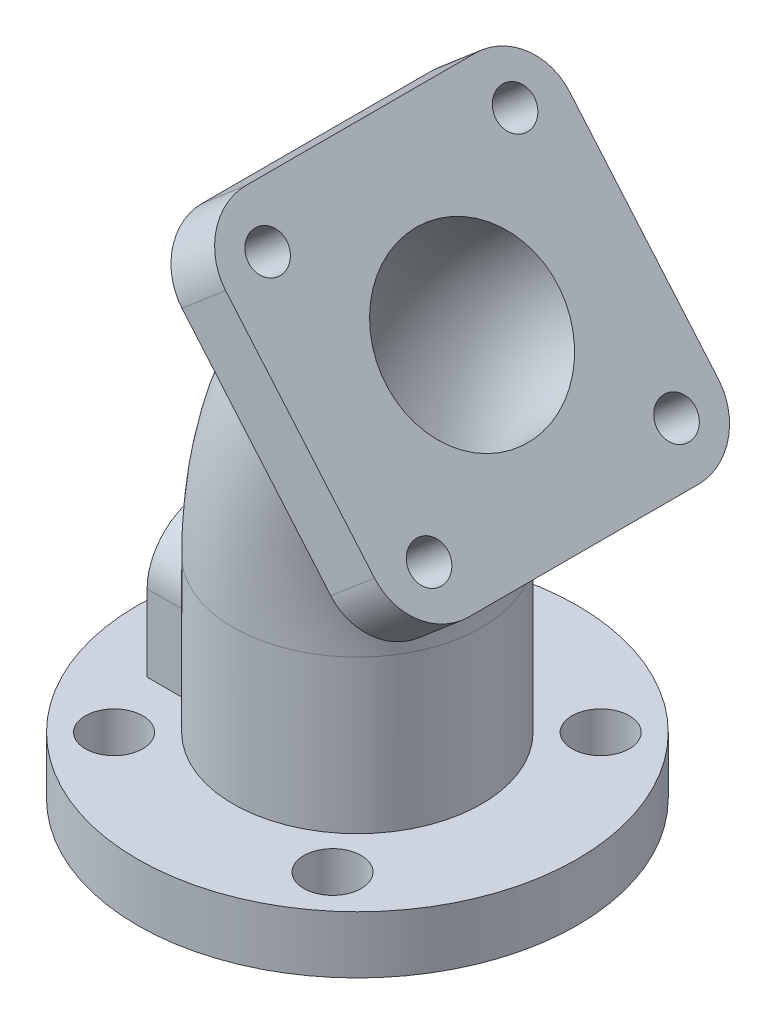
ISO-10303-21;
HEADER;
FILE_DESCRIPTION(('STEP AP214'),'2;1');
FILE_NAME('part.step','',(''),(''),'','','');
FILE_SCHEMA(('AUTOMOTIVE_DESIGN { 1 0 10303 214 1 1 1 1 }'));
ENDSEC;
DATA;
#1=APPLICATION_CONTEXT('core data for automotive mechanical design processes');
#2=APPLICATION_PROTOCOL_DEFINITION('international standard','automotive_design',2000,#1);
#3=PRODUCT_CONTEXT('',#1,'mechanical');
#4=PRODUCT('Part','Part','',(#3));
#5=PRODUCT_RELATED_PRODUCT_CATEGORY('part','',(#4));
#6=PRODUCT_DEFINITION_FORMATION('','',#4);
#7=PRODUCT_DEFINITION_CONTEXT('part definition',#1,'design');
#8=PRODUCT_DEFINITION('design','',#6,#7);
#9=PRODUCT_DEFINITION_SHAPE('','',#8);
#10=(LENGTH_UNIT() NAMED_UNIT(*) SI_UNIT(.MILLI.,.METRE.));
#11=(NAMED_UNIT(*) PLANE_ANGLE_UNIT() SI_UNIT($,.RADIAN.));
#12=(NAMED_UNIT(*) SI_UNIT($,.STERADIAN.) SOLID_ANGLE_UNIT());
#13=UNCERTAINTY_MEASURE_WITH_UNIT(LENGTH_MEASURE(1.E-05),#10,'distance_accuracy_value','');
#14=(GEOMETRIC_REPRESENTATION_CONTEXT(3) GLOBAL_UNCERTAINTY_ASSIGNED_CONTEXT((#13)) GLOBAL_UNIT_ASSIGNED_CONTEXT((#10,
#11,#12)) REPRESENTATION_CONTEXT('',''));
#15=CARTESIAN_POINT('',(0.,0.,0.));
#16=DIRECTION('',(0.,0.,1.));
#17=DIRECTION('',(1.,0.,0.));
#18=AXIS2_PLACEMENT_3D('',#15,#16,#17);
#19=CARTESIAN_POINT('',(0.,22.,0.));
#20=DIRECTION('',(0.,-1.,0.));
#21=DIRECTION('',(0.,0.,-1.));
#22=AXIS2_PLACEMENT_3D('',#19,#20,#21);
#23=CYLINDRICAL_SURFACE('',#22,13.);
#24=CARTESIAN_POINT('',(0.,22.,0.));
#25=DIRECTION('',(0.,1.,0.));
#26=DIRECTION('',(0.,0.,1.));
#27=AXIS2_PLACEMENT_3D('',#24,#25,#26);
#28=CIRCLE('',#27,13.);
#29=CARTESIAN_POINT('',(0.,22.,13.));
#30=VERTEX_POINT('',#29);
#31=EDGE_CURVE('E44',#30,#30,#28,.T.);
#32=ORIENTED_EDGE('',*,*,#31,.F.);
#33=EDGE_LOOP('',(#32));
#34=FACE_BOUND('',#33,.T.);
#35=DIRECTION('',(0.,-1.,0.));
#36=VECTOR('',#35,1.);
#37=CARTESIAN_POINT('',(-11.5325625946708,22.,-6.));
#38=LINE('',#37,#36);
#39=CARTESIAN_POINT('',(-11.5325625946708,6.,-6.));
#40=VERTEX_POINT('',#39);
#41=CARTESIAN_POINT('',(-11.5325625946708,14.,-6.));
#42=VERTEX_POINT('',#41);
#43=EDGE_CURVE('E51',#40,#42,#38,.F.);
#44=ORIENTED_EDGE('',*,*,#43,.T.);
#45=CARTESIAN_POINT('',(-11.5325625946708,14.,-6.));
#46=CARTESIAN_POINT('',(-11.5325209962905,14.1589053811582,-6.00002784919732));
#47=CARTESIAN_POINT('',(-11.5358455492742,14.3177921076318,-5.99368858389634));
#48=CARTESIAN_POINT('',(-11.548918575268,14.6342241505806,-5.96848785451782));
#49=CARTESIAN_POINT('',(-11.5586637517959,14.7917701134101,-5.94963281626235));
#50=CARTESIAN_POINT('',(-11.5842063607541,15.1036023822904,-5.8997369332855));
#51=CARTESIAN_POINT('',(-11.5999733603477,15.2579010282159,-5.86875734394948));
#52=CARTESIAN_POINT('',(-11.6370087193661,15.5629740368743,-5.79497550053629));
#53=CARTESIAN_POINT('',(-11.65827758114,15.7137480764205,-5.75217216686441));
#54=CARTESIAN_POINT('',(-11.7055871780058,16.0105205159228,-5.65527380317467));
#55=CARTESIAN_POINT('',(-11.7316185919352,16.1565275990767,-5.60120080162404));
#56=CARTESIAN_POINT('',(-11.7876960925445,16.4432727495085,-5.4822028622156));
#57=CARTESIAN_POINT('',(-11.8177436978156,16.5840087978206,-5.41727381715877));
#58=CARTESIAN_POINT('',(-11.9127142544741,16.9974364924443,-5.20681638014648));
#59=CARTESIAN_POINT('',(-11.9824494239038,17.2612556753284,-5.04564800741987));
#60=CARTESIAN_POINT('',(-12.1326813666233,17.7771982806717,-4.67343852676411));
#61=CARTESIAN_POINT('',(-12.2135887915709,18.0272539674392,-4.45972083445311));
#62=CARTESIAN_POINT('',(-12.3737525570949,18.4896324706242,-3.99383731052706));
#63=CARTESIAN_POINT('',(-12.4530084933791,18.7019461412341,-3.74166218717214));
#64=CARTESIAN_POINT('',(-12.5668091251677,18.9933205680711,-3.33123038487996));
#65=CARTESIAN_POINT('',(-12.604811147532,19.0880002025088,-3.18477413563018));
#66=CARTESIAN_POINT('',(-12.6771189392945,19.2645834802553,-2.8835049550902));
#67=CARTESIAN_POINT('',(-12.7114261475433,19.3464921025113,-2.72869531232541));
#68=CARTESIAN_POINT('',(-12.7753528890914,19.4967502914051,-2.41174186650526));
#69=CARTESIAN_POINT('',(-12.8049733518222,19.5651025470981,-2.24959952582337));
#70=CARTESIAN_POINT('',(-12.8586543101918,19.6875320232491,-1.91911912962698));
#71=CARTESIAN_POINT('',(-12.8827152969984,19.7416105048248,-1.75078162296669));
#72=CARTESIAN_POINT('',(-12.9232348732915,19.8319399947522,-1.4198727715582));
#73=CARTESIAN_POINT('',(-12.9400729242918,19.8690898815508,-1.2575929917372));
#74=CARTESIAN_POINT('',(-12.967732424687,19.9298243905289,-0.930013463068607));
#75=CARTESIAN_POINT('',(-12.9785543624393,19.9534101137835,-0.764713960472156));
#76=CARTESIAN_POINT('',(-12.99386730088,19.9867191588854,-0.43249652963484));
#77=CARTESIAN_POINT('',(-12.9983607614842,19.9964478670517,-0.26557925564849));
#78=CARTESIAN_POINT('',(-13.0008925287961,20.0019341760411,0.0685301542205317));
#79=CARTESIAN_POINT('',(-12.9989311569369,19.997692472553,0.235722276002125));
#80=CARTESIAN_POINT('',(-12.9889988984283,19.9761335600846,0.556517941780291));
#81=CARTESIAN_POINT('',(-12.9814875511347,19.9598160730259,0.710204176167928));
#82=CARTESIAN_POINT('',(-12.9611744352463,19.9154401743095,1.01556784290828));
#83=CARTESIAN_POINT('',(-12.9483709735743,19.8873780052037,1.16724461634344));
#84=CARTESIAN_POINT('',(-12.9177914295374,19.8198145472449,1.46745509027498));
#85=CARTESIAN_POINT('',(-12.9000170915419,19.7803172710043,1.61598987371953));
#86=CARTESIAN_POINT('',(-12.8599100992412,19.6902471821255,1.9090847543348));
#87=CARTESIAN_POINT('',(-12.8375757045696,19.6396701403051,2.0536433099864));
#88=CARTESIAN_POINT('',(-12.78850865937,19.5270751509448,2.33996618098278));
#89=CARTESIAN_POINT('',(-12.7617165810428,19.4649010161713,2.48165893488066));
#90=CARTESIAN_POINT('',(-12.7045872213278,19.3301269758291,2.75927329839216));
#91=CARTESIAN_POINT('',(-12.6742486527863,19.2575232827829,2.89519278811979));
#92=CARTESIAN_POINT('',(-12.578911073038,19.0248474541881,3.29320920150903));
#93=CARTESIAN_POINT('',(-12.5095598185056,18.8498431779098,3.54573414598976));
#94=CARTESIAN_POINT('',(-12.3592444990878,18.4484176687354,4.03997789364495));
#95=CARTESIAN_POINT('',(-12.2777942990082,18.2189234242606,4.2790340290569));
#96=CARTESIAN_POINT('',(-12.1163930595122,17.723140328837,4.71672181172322));
#97=CARTESIAN_POINT('',(-12.0364430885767,17.4568263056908,4.91532557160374));
#98=CARTESIAN_POINT('',(-11.9224378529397,17.0273525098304,5.18319876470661));
#99=CARTESIAN_POINT('',(-11.884627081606,16.8753103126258,5.26908064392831));
#100=CARTESIAN_POINT('',(-11.8130826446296,16.5635725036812,5.42758022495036));
#101=CARTESIAN_POINT('',(-11.7793471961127,16.4038802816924,5.50020373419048));
#102=CARTESIAN_POINT('',(-11.7172085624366,16.078098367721,5.63136702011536));
#103=CARTESIAN_POINT('',(-11.6887972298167,15.912018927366,5.68992835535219));
#104=CARTESIAN_POINT('',(-11.6383567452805,15.5745427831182,5.79240100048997));
#105=CARTESIAN_POINT('',(-11.6163247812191,15.4031484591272,5.83631876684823));
#106=CARTESIAN_POINT('',(-11.5766050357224,15.0284625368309,5.91476890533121));
#107=CARTESIAN_POINT('',(-11.5601823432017,14.8244671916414,5.94666297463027));
#108=CARTESIAN_POINT('',(-11.5436628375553,14.516449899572,5.97862623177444));
#109=CARTESIAN_POINT('',(-11.539508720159,14.4133965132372,5.98663436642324));
#110=CARTESIAN_POINT('',(-11.5339559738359,14.20690421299,5.99732270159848));
#111=CARTESIAN_POINT('',(-11.5325583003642,14.1034651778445,6.00000105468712));
#112=CARTESIAN_POINT('',(-11.5325625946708,14.,6.));
#113=B_SPLINE_CURVE_WITH_KNOTS('',3,(#45,#46,#47,#48,#49,#50,#51,#52,#53,#54,#55,#56,#57,#58,
#59,#60,#61,#62,#63,#64,#65,#66,#67,#68,#69,#70,#71,#72,#73,#74,#75,#76,#77,#78,#79,#80,#81,#82,
#83,#84,#85,#86,#87,#88,#89,#90,#91,#92,#93,#94,#95,#96,#97,#98,#99,#100,#101,#102,#103,#104,
#105,#106,#107,#108,#109,#110,#111,#112),.UNSPECIFIED.,.F.,.F.,(4,2,2,2,2,2,2,2,2,2,2,2,2,2,2,2,
2,2,2,2,2,2,2,2,2,2,2,2,2,2,2,2,2,4),(0.,0.47652557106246,0.952806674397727,1.42671195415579,
1.90066051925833,2.373691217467,2.84690128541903,3.79361246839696,4.80573888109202,
5.81811022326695,6.35299824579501,6.88767721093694,7.42225001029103,7.95677556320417,
8.45809066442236,8.95936506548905,9.46044456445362,9.96149911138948,10.4251500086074,
10.8889493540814,11.3525861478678,11.8164002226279,12.286982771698,12.7577366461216,
13.698694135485,14.7182160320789,15.7384384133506,16.2738595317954,16.8090455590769,
17.3434057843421,17.8775300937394,18.4973953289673,18.8075878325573,19.1178878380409),.UNSPECIFIED.);
#114=CARTESIAN_POINT('',(-11.5325625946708,14.,6.));
#115=VERTEX_POINT('',#114);
#116=EDGE_CURVE('E55',#42,#115,#113,.T.);
#117=ORIENTED_EDGE('',*,*,#116,.T.);
#118=DIRECTION('',(0.,-1.,0.));
#119=VECTOR('',#118,1.);
#120=CARTESIAN_POINT('',(-11.5325625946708,22.,6.));
#121=LINE('',#120,#119);
#122=CARTESIAN_POINT('',(-11.5325625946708,6.,6.));
#123=VERTEX_POINT('',#122);
#124=EDGE_CURVE('E158',#115,#123,#121,.T.);
#125=ORIENTED_EDGE('',*,*,#124,.T.);
#126=CARTESIAN_POINT('',(0.,6.,0.));
#127=DIRECTION('',(0.,1.,0.));
#128=DIRECTION('',(0.,0.,1.));
#129=AXIS2_PLACEMENT_3D('',#126,#127,#128);
#130=CIRCLE('',#129,13.);
#131=EDGE_CURVE('E267',#123,#40,#130,.T.);
#132=ORIENTED_EDGE('',*,*,#131,.T.);
#133=EDGE_LOOP('',(#44,#117,#125,#132));
#134=FACE_BOUND('',#133,.T.);
#135=ADVANCED_FACE('F31',(#34,#134),#23,.T.);
#136=CARTESIAN_POINT('',(0.,6.,0.));
#137=DIRECTION('',(0.,1.,0.));
#138=DIRECTION('',(0.,0.,1.));
#139=AXIS2_PLACEMENT_3D('',#136,#137,#138);
#140=PLANE('',#139);
#141=CARTESIAN_POINT('',(11.3606956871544,6.,13.961897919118));
#142=DIRECTION('',(0.,1.,0.));
#143=DIRECTION('',(0.,0.,1.));
#144=AXIS2_PLACEMENT_3D('',#141,#142,#143);
#145=CIRCLE('',#144,3.);
#146=CARTESIAN_POINT('',(11.3606956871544,6.,16.961897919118));
#147=VERTEX_POINT('',#146);
#148=EDGE_CURVE('E461',#147,#147,#145,.T.);
#149=ORIENTED_EDGE('',*,*,#148,.F.);
#150=EDGE_LOOP('',(#149));
#151=FACE_BOUND('',#150,.T.);
#152=CARTESIAN_POINT('',(-12.7279220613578,6.,12.7279220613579));
#153=DIRECTION('',(0.,1.,0.));
#154=DIRECTION('',(0.,0.,1.));
#155=AXIS2_PLACEMENT_3D('',#152,#153,#154);
#156=CIRCLE('',#155,3.);
#157=CARTESIAN_POINT('',(-12.7279220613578,6.,15.7279220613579));
#158=VERTEX_POINT('',#157);
#159=EDGE_CURVE('E463',#158,#158,#156,.T.);
#160=ORIENTED_EDGE('',*,*,#159,.F.);
#161=EDGE_LOOP('',(#160));
#162=FACE_BOUND('',#161,.T.);
#163=CARTESIAN_POINT('',(-13.9618979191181,6.,-11.3606956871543));
#164=DIRECTION('',(0.,1.,0.));
#165=DIRECTION('',(0.,0.,1.));
#166=AXIS2_PLACEMENT_3D('',#163,#164,#165);
#167=CIRCLE('',#166,3.);
#168=CARTESIAN_POINT('',(-13.9618979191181,6.,-8.36069568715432));
#169=VERTEX_POINT('',#168);
#170=EDGE_CURVE('E469',#169,#169,#167,.T.);
#171=ORIENTED_EDGE('',*,*,#170,.F.);
#172=EDGE_LOOP('',(#171));
#173=FACE_BOUND('',#172,.T.);
#174=CARTESIAN_POINT('',(12.7279220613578,6.,-12.7279220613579));
#175=DIRECTION('',(0.,1.,0.));
#176=DIRECTION('',(0.,0.,1.));
#177=AXIS2_PLACEMENT_3D('',#174,#175,#176);
#178=CIRCLE('',#177,3.);
#179=CARTESIAN_POINT('',(12.7279220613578,6.,-9.72792206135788));
#180=VERTEX_POINT('',#179);
#181=EDGE_CURVE('E475',#180,#180,#178,.T.);
#182=ORIENTED_EDGE('',*,*,#181,.F.);
#183=EDGE_LOOP('',(#182));
#184=FACE_BOUND('',#183,.T.);
#185=CARTESIAN_POINT('',(0.,6.,0.));
#186=DIRECTION('',(0.,1.,0.));
#187=DIRECTION('',(0.,0.,1.));
#188=AXIS2_PLACEMENT_3D('',#185,#186,#187);
#189=CIRCLE('',#188,23.);
#190=CARTESIAN_POINT('',(0.,6.,23.));
#191=VERTEX_POINT('',#190);
#192=EDGE_CURVE('E270',#191,#191,#189,.T.);
#193=ORIENTED_EDGE('',*,*,#192,.T.);
#194=EDGE_LOOP('',(#193));
#195=FACE_BOUND('',#194,.T.);
#196=DIRECTION('',(0.,0.,-1.));
#197=VECTOR('',#196,1.);
#198=CARTESIAN_POINT('',(-16.,6.,-6.));
#199=LINE('',#198,#197);
#200=CARTESIAN_POINT('',(-16.,6.,6.));
#201=VERTEX_POINT('',#200);
#202=CARTESIAN_POINT('',(-16.,6.,-6.));
#203=VERTEX_POINT('',#202);
#204=EDGE_CURVE('E147',#201,#203,#199,.T.);
#205=ORIENTED_EDGE('',*,*,#204,.T.);
#206=DIRECTION('',(-1.,0.,0.));
#207=VECTOR('',#206,1.);
#208=CARTESIAN_POINT('',(500000.,6.,-6.));
#209=LINE('',#208,#207);
#210=EDGE_CURVE('E133',#40,#203,#209,.T.);
#211=ORIENTED_EDGE('',*,*,#210,.F.);
#212=ORIENTED_EDGE('',*,*,#131,.F.);
#213=DIRECTION('',(-1.,0.,0.));
#214=VECTOR('',#213,1.);
#215=CARTESIAN_POINT('',(500000.,6.,6.));
#216=LINE('',#215,#214);
#217=EDGE_CURVE('E141',#123,#201,#216,.T.);
#218=ORIENTED_EDGE('',*,*,#217,.T.);
#219=EDGE_LOOP('',(#205,#211,#212,#218));
#220=FACE_BOUND('',#219,.T.);
#221=ADVANCED_FACE('F181',(#151,#162,#173,#184,#195,#220),#140,.T.);
#222=CARTESIAN_POINT('',(34.1666666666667,22.,0.));
#223=DIRECTION('',(0.,0.,-1.));
#224=DIRECTION('',(-1.,0.,0.));
#225=AXIS2_PLACEMENT_3D('',#222,#223,#224);
#226=TOROIDAL_SURFACE('',#225,34.1666666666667,13.);
#227=ORIENTED_EDGE('',*,*,#31,.T.);
#228=EDGE_LOOP('',(#227));
#229=FACE_BOUND('',#228,.T.);
#230=CARTESIAN_POINT('',(7.72502886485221,43.7661315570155,-12.999745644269));
#231=CARTESIAN_POINT('',(7.97102539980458,43.4775942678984,-13.0020827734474));
#232=CARTESIAN_POINT('',(8.21706362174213,43.1890080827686,-12.9883278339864));
#233=CARTESIAN_POINT('',(8.70758932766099,42.6136546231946,-12.9288289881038));
#234=CARTESIAN_POINT('',(8.95207633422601,42.3268879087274,-12.883075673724));
#235=CARTESIAN_POINT('',(9.43796579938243,41.7569724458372,-12.7599032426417));
#236=CARTESIAN_POINT('',(9.67936421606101,41.4738284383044,-12.6824462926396));
#237=CARTESIAN_POINT('',(10.1570784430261,40.913501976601,-12.4964781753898));
#238=CARTESIAN_POINT('',(10.3933941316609,40.6363196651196,-12.38796626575));
#239=CARTESIAN_POINT('',(10.859093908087,40.0900853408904,-12.1407900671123));
#240=CARTESIAN_POINT('',(11.0884830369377,39.8210274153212,-12.0021483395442));
#241=CARTESIAN_POINT('',(11.5388992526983,39.2927196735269,-11.6956521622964));
#242=CARTESIAN_POINT('',(11.7599261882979,39.0334700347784,-11.5277971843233));
#243=CARTESIAN_POINT('',(12.1919932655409,38.5266845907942,-11.1640807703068));
#244=CARTESIAN_POINT('',(12.4030356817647,38.2791461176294,-10.9682257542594));
#245=CARTESIAN_POINT('',(12.8136618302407,37.7975094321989,-10.549814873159));
#246=CARTESIAN_POINT('',(13.0132459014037,37.5634108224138,-10.3272597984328));
#247=CARTESIAN_POINT('',(13.3998539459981,37.1099457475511,-9.85649508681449));
#248=CARTESIAN_POINT('',(13.5868538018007,36.8906075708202,-9.60823838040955));
#249=CARTESIAN_POINT('',(13.9464615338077,36.4688120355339,-9.08807515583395));
#250=CARTESIAN_POINT('',(14.1190693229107,36.2663547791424,-8.81616849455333));
#251=CARTESIAN_POINT('',(14.4485273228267,35.8799228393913,-8.25053035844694));
#252=CARTESIAN_POINT('',(14.6053772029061,35.6959485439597,-7.95679842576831));
#253=CARTESIAN_POINT('',(14.9020090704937,35.3480194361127,-7.34952302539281));
#254=CARTESIAN_POINT('',(15.0417913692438,35.1840642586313,-7.0359799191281));
#255=CARTESIAN_POINT('',(15.3008080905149,34.8802551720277,-6.39683558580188));
#256=CARTESIAN_POINT('',(15.4203552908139,34.7400343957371,-6.07153554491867));
#257=CARTESIAN_POINT('',(15.640707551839,34.48157610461,-5.4061793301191));
#258=CARTESIAN_POINT('',(15.7415127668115,34.3633384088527,-5.06612327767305));
#259=CARTESIAN_POINT('',(15.9233992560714,34.1499978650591,-4.37378490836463));
#260=CARTESIAN_POINT('',(16.0044850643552,34.0548896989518,-4.02150542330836));
#261=CARTESIAN_POINT('',(16.146144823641,33.8887323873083,-3.30728012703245));
#262=CARTESIAN_POINT('',(16.2067194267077,33.8176824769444,-2.94533462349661));
#263=CARTESIAN_POINT('',(16.3049181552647,33.7025020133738,-2.22774319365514));
#264=CARTESIAN_POINT('',(16.3432906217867,33.6574937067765,-1.87234023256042));
#265=CARTESIAN_POINT('',(16.3999966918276,33.5909813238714,-1.15775800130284));
#266=CARTESIAN_POINT('',(16.4183308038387,33.5694766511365,-0.798578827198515));
#267=CARTESIAN_POINT('',(16.4347696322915,33.5501950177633,-0.0791759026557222));
#268=CARTESIAN_POINT('',(16.4328773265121,33.5524145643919,0.281047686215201));
#269=CARTESIAN_POINT('',(16.4088901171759,33.5805499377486,0.999890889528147));
#270=CARTESIAN_POINT('',(16.3867954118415,33.6064655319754,1.35851051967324));
#271=CARTESIAN_POINT('',(16.3234184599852,33.680802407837,2.06274927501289));
#272=CARTESIAN_POINT('',(16.2826186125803,33.7286578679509,2.40847186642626));
#273=CARTESIAN_POINT('',(16.1824048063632,33.8462018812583,3.09343657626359));
#274=CARTESIAN_POINT('',(16.1229912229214,33.9158899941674,3.43267882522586));
#275=CARTESIAN_POINT('',(15.9860970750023,34.0764575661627,4.10240175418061));
#276=CARTESIAN_POINT('',(15.9086155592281,34.1673381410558,4.43288197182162));
#277=CARTESIAN_POINT('',(15.7362732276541,34.369484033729,5.0828929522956));
#278=CARTESIAN_POINT('',(15.6414120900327,34.4807497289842,5.40242351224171));
#279=CARTESIAN_POINT('',(15.4336287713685,34.724465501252,6.03298977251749));
#280=CARTESIAN_POINT('',(15.3204670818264,34.8571965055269,6.34383792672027));
#281=CARTESIAN_POINT('',(15.0780117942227,35.1415801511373,6.95020104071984));
#282=CARTESIAN_POINT('',(14.9487181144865,35.2932328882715,7.24571592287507));
#283=CARTESIAN_POINT('',(14.6749862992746,35.6143017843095,7.81962622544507));
#284=CARTESIAN_POINT('',(14.5305465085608,35.7837198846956,8.0980197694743));
#285=CARTESIAN_POINT('',(14.2275920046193,36.1390650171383,8.63598910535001));
#286=CARTESIAN_POINT('',(14.0690765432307,36.3249929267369,8.89556389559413));
#287=CARTESIAN_POINT('',(13.7331288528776,36.7190368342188,9.40335308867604));
#288=CARTESIAN_POINT('',(13.5552203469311,36.9277114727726,9.65081925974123));
#289=CARTESIAN_POINT('',(13.1867829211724,37.3598636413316,10.1223230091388));
#290=CARTESIAN_POINT('',(12.9962537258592,37.5833414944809,10.3463600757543));
#291=CARTESIAN_POINT('',(12.6038906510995,38.0435568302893,10.7696116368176));
#292=CARTESIAN_POINT('',(12.4020554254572,38.280295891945,10.9688231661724));
#293=CARTESIAN_POINT('',(11.9884890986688,38.7653812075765,11.3411170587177));
#294=CARTESIAN_POINT('',(11.7767580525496,39.0137273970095,11.5141995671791));
#295=CARTESIAN_POINT('',(11.3393338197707,39.5267964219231,11.83716761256));
#296=CARTESIAN_POINT('',(11.1134225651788,39.7917750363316,11.9863519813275));
#297=CARTESIAN_POINT('',(10.654281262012,40.330316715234,12.2550192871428));
#298=CARTESIAN_POINT('',(10.421051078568,40.6038799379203,12.3745016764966));
#299=CARTESIAN_POINT('',(9.94890072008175,41.1576803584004,12.582897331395));
#300=CARTESIAN_POINT('',(9.70998033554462,41.4379178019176,12.6718094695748));
#301=CARTESIAN_POINT('',(9.22813734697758,42.0030870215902,12.8183752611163));
#302=CARTESIAN_POINT('',(8.985214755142,42.2880187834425,12.8760290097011));
#303=CARTESIAN_POINT('',(8.49608438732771,42.8617356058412,12.9597642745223));
#304=CARTESIAN_POINT('',(8.24986725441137,43.1505316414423,12.9857160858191));
#305=CARTESIAN_POINT('',(7.75688920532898,43.7287615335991,13.0053379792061));
#306=CARTESIAN_POINT('',(7.51012828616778,44.0181953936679,12.9990078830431));
#307=CARTESIAN_POINT('',(7.01785497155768,44.5955986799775,12.9540086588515));
#308=CARTESIAN_POINT('',(6.7723425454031,44.883568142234,12.9153403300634));
#309=CARTESIAN_POINT('',(6.28435542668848,45.4559440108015,12.805837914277));
#310=CARTESIAN_POINT('',(6.04188070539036,45.7403504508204,12.7350041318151));
#311=CARTESIAN_POINT('',(5.56404032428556,46.3008248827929,12.5624045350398));
#312=CARTESIAN_POINT('',(5.32862901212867,46.5769464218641,12.460938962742));
#313=CARTESIAN_POINT('',(4.86426455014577,47.121614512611,12.2274812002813));
#314=CARTESIAN_POINT('',(4.63531137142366,47.3901610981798,12.0954891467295));
#315=CARTESIAN_POINT('',(4.18556706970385,47.9176807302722,11.8018470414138));
#316=CARTESIAN_POINT('',(3.96477554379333,48.1766542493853,11.6401984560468));
#317=CARTESIAN_POINT('',(3.53299166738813,48.6831075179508,11.2883313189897));
#318=CARTESIAN_POINT('',(3.32199922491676,48.9305873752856,11.0981130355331));
#319=CARTESIAN_POINT('',(2.91412287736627,49.4089987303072,10.6931278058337));
#320=CARTESIAN_POINT('',(2.71708914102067,49.6401059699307,10.4787193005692));
#321=CARTESIAN_POINT('',(2.33556697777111,50.0876056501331,10.0248471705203));
#322=CARTESIAN_POINT('',(2.15107844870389,50.3039982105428,9.78538374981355));
#323=CARTESIAN_POINT('',(1.79602954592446,50.7204465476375,9.28309084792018));
#324=CARTESIAN_POINT('',(1.62546850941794,50.9205031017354,9.02026247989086));
#325=CARTESIAN_POINT('',(1.29954494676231,51.3027893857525,8.47309653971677));
#326=CARTESIAN_POINT('',(1.14418231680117,51.4850192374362,8.1887591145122));
#327=CARTESIAN_POINT('',(0.851531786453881,51.8282785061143,7.60402244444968));
#328=CARTESIAN_POINT('',(0.714055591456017,51.9895287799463,7.3038470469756));
#329=CARTESIAN_POINT('',(0.456116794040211,52.29207353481,6.68660510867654));
#330=CARTESIAN_POINT('',(0.335654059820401,52.4333681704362,6.36953869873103));
#331=CARTESIAN_POINT('',(0.112643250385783,52.694944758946,5.72078992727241));
#332=CARTESIAN_POINT('',(0.0100945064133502,52.815227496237,5.38910811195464));
#333=CARTESIAN_POINT('',(-0.176326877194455,53.0338871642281,4.71350079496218));
#334=CARTESIAN_POINT('',(-0.260199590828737,53.1322641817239,4.36957534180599));
#335=CARTESIAN_POINT('',(-0.408048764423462,53.3056812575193,3.67474404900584));
#336=CARTESIAN_POINT('',(-0.472178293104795,53.3809008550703,3.32391557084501));
#337=CARTESIAN_POINT('',(-0.580964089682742,53.5084992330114,2.61515831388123));
#338=CARTESIAN_POINT('',(-0.625620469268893,53.5608781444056,2.25722957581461));
#339=CARTESIAN_POINT('',(-0.695128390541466,53.6424062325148,1.53683976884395));
#340=CARTESIAN_POINT('',(-0.719980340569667,53.671555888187,1.17437879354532));
#341=CARTESIAN_POINT('',(-0.74969646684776,53.7064108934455,0.447515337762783));
#342=CARTESIAN_POINT('',(-0.754560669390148,53.7121162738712,0.0831128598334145));
#343=CARTESIAN_POINT('',(-0.744285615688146,53.7000643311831,-0.643586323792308));
#344=CARTESIAN_POINT('',(-0.729224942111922,53.6823991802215,-1.00588567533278));
#345=CARTESIAN_POINT('',(-0.679348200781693,53.623897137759,-1.72723809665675));
#346=CARTESIAN_POINT('',(-0.64453219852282,53.5830603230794,-2.08629117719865));
#347=CARTESIAN_POINT('',(-0.55540137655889,53.4785159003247,-2.7985979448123));
#348=CARTESIAN_POINT('',(-0.501086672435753,53.4148084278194,-3.15185166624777));
#349=CARTESIAN_POINT('',(-0.373357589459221,53.2649908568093,-3.85005768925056));
#350=CARTESIAN_POINT('',(-0.299943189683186,53.1788807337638,-4.19500998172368));
#351=CARTESIAN_POINT('',(-0.134543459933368,52.9848780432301,-4.87421508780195));
#352=CARTESIAN_POINT('',(-0.0425559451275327,52.8769829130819,-5.2084666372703));
#353=CARTESIAN_POINT('',(0.159311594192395,52.6402059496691,-5.86387546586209));
#354=CARTESIAN_POINT('',(0.269191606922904,52.5113241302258,-6.18503275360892));
#355=CARTESIAN_POINT('',(0.506039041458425,52.2335181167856,-6.81199536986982));
#356=CARTESIAN_POINT('',(0.633005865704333,52.0845946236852,-7.11780123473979));
#357=CARTESIAN_POINT('',(0.903108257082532,51.767782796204,-7.71194883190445));
#358=CARTESIAN_POINT('',(1.04624386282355,51.5998944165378,-8.00029052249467));
#359=CARTESIAN_POINT('',(1.34825128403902,51.2456601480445,-8.55863475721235));
#360=CARTESIAN_POINT('',(1.50718356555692,51.05924333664,-8.82855959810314));
#361=CARTESIAN_POINT('',(1.83915373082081,50.669864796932,-9.34694822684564));
#362=CARTESIAN_POINT('',(2.01219169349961,50.4669029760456,-9.59541189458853));
#363=CARTESIAN_POINT('',(2.37117753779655,50.0458368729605,-10.0692553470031));
#364=CARTESIAN_POINT('',(2.55712898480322,49.8277284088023,-10.2946287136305));
#365=CARTESIAN_POINT('',(2.94056700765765,49.3779815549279,-10.7207007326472));
#366=CARTESIAN_POINT('',(3.13805346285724,49.1463433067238,-10.9213996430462));
#367=CARTESIAN_POINT('',(3.54488860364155,48.6691532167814,-11.2984036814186));
#368=CARTESIAN_POINT('',(3.75432392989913,48.4234997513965,-11.4744866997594));
#369=CARTESIAN_POINT('',(4.18200813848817,47.9218551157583,-11.7990640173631));
#370=CARTESIAN_POINT('',(4.40025715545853,47.6658637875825,-11.947557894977));
#371=CARTESIAN_POINT('',(4.84379091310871,47.1456287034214,-12.2158683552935));
#372=CARTESIAN_POINT('',(5.06906805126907,46.8813938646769,-12.3357147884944));
#373=CARTESIAN_POINT('',(5.52522067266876,46.3463577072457,-12.5461669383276));
#374=CARTESIAN_POINT('',(5.75609468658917,46.0755581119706,-12.6367802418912));
#375=CARTESIAN_POINT('',(6.27421403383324,45.467839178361,-12.8052905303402));
#376=CARTESIAN_POINT('',(6.56248623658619,45.1297153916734,-12.8757743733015));
#377=CARTESIAN_POINT('',(7.142162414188,44.4497944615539,-12.971617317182));
#378=CARTESIAN_POINT('',(7.433566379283,44.1079973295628,-12.9969765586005));
#379=CARTESIAN_POINT('',(7.72502886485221,43.7661315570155,-12.999745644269));
#380=B_SPLINE_CURVE_WITH_KNOTS('',3,(#230,#231,#232,#233,#234,#235,#236,#237,#238,#239,#240,
#241,#242,#243,#244,#245,#246,#247,#248,#249,#250,#251,#252,#253,#254,#255,#256,#257,#258,#259,
#260,#261,#262,#263,#264,#265,#266,#267,#268,#269,#270,#271,#272,#273,#274,#275,#276,#277,#278,
#279,#280,#281,#282,#283,#284,#285,#286,#287,#288,#289,#290,#291,#292,#293,#294,#295,#296,#297,
#298,#299,#300,#301,#302,#303,#304,#305,#306,#307,#308,#309,#310,#311,#312,#313,#314,#315,#316,
#317,#318,#319,#320,#321,#322,#323,#324,#325,#326,#327,#328,#329,#330,#331,#332,#333,#334,#335,
#336,#337,#338,#339,#340,#341,#342,#343,#344,#345,#346,#347,#348,#349,#350,#351,#352,#353,#354,
#355,#356,#357,#358,#359,#360,#361,#362,#363,#364,#365,#366,#367,#368,#369,#370,#371,#372,#373,
#374,#375,#376,#377,#378,#379),.UNSPECIFIED.,.T.,.F.,(4,2,2,2,2,2,2,2,2,2,2,2,2,2,2,2,2,2,2,2,2,
2,2,2,2,2,2,2,2,2,2,2,2,2,2,2,2,2,2,2,2,2,2,2,2,2,2,2,2,2,2,2,2,2,2,2,2,2,2,2,2,2,2,2,2,2,2,2,2,
2,2,2,2,2,4),(0.,1.13712584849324,2.27458616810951,3.41340784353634,4.55225674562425,
5.690255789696,6.82827541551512,7.96603452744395,9.1037599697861,10.2436071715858,
11.3834612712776,12.5233392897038,13.6631965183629,14.7833969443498,15.903588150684,
17.0235215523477,18.14341934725,19.2229629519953,20.3024791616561,21.3818364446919,
22.461183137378,23.5141368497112,24.5670693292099,25.6200572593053,26.6730646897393,
27.7411736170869,28.8092879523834,29.8775191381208,30.9458071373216,32.052654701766,
33.1595264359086,34.2665302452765,35.373527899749,36.5086536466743,37.643800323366,
38.7789888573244,39.9141739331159,41.0539881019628,42.1938085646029,43.333600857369,
44.4733823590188,45.6023361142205,46.7312848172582,47.8601777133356,48.989060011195,
50.1029931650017,51.2169172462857,52.3307882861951,53.4446517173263,54.545630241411,
55.6466002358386,56.7475291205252,57.8484536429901,58.9406142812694,60.0327686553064,
61.124900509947,62.2170309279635,63.3048668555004,64.39269917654,65.4805250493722,
66.5683521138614,67.6563072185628,68.7442616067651,69.8321779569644,70.9200969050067,
72.0123534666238,73.1046161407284,74.197181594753,75.2897356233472,76.3915866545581,
77.4934545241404,78.5941691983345,79.6945979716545,81.041895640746,82.3891891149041),.UNSPECIFIED.);
#381=CARTESIAN_POINT('',(7.72502886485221,43.7661315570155,-12.999745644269));
#382=VERTEX_POINT('',#381);
#383=EDGE_CURVE('E36',#382,#382,#380,.T.);
#384=ORIENTED_EDGE('',*,*,#383,.T.);
#385=EDGE_LOOP('',(#384));
#386=FACE_BOUND('',#385,.T.);
#387=ADVANCED_FACE('F33',(#229,#386),#226,.T.);
#388=CARTESIAN_POINT('',(34.1666666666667,22.,0.));
#389=DIRECTION('',(0.,0.,-1.));
#390=DIRECTION('',(-1.,0.,0.));
#391=AXIS2_PLACEMENT_3D('',#388,#389,#390);
#392=TOROIDAL_SURFACE('',#391,34.1666666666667,9.);
#393=CARTESIAN_POINT('',(0.,22.,0.));
#394=DIRECTION('',(0.,1.,0.));
#395=DIRECTION('',(0.,0.,1.));
#396=AXIS2_PLACEMENT_3D('',#393,#394,#395);
#397=CIRCLE('',#396,9.);
#398=CARTESIAN_POINT('',(-9.,22.,0.));
#399=VERTEX_POINT('',#398);
#400=EDGE_CURVE('E208',#399,#399,#397,.T.);
#401=CARTESIAN_POINT('',(12.,48.,0.));
#402=DIRECTION('',(0.760975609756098,0.648780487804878,0.));
#403=DIRECTION('',(0.,0.,1.));
#404=AXIS2_PLACEMENT_3D('',#401,#402,#403);
#405=CIRCLE('',#404,9.);
#406=CARTESIAN_POINT('',(6.1609756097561,54.8487804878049,0.));
#407=VERTEX_POINT('',#406);
#408=EDGE_CURVE('E11',#407,#407,#405,.T.);
#409=CARTESIAN_POINT('',(34.1666666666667,22.,0.));
#410=DIRECTION('',(0.,0.,-1.));
#411=DIRECTION('',(-1.,0.,0.));
#412=AXIS2_PLACEMENT_3D('',#409,#410,#411);
#413=CIRCLE('',#412,43.1666666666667);
#414=EDGE_CURVE('',#399,#407,#413,.T.);
#415=ORIENTED_EDGE('',*,*,#400,.F.);
#416=ORIENTED_EDGE('',*,*,#408,.T.);
#417=ORIENTED_EDGE('',*,*,#414,.T.);
#418=ORIENTED_EDGE('',*,*,#414,.F.);
#419=EDGE_LOOP('',(#415,#417,#416,#418));
#420=FACE_BOUND('',#419,.T.);
#421=ADVANCED_FACE('F197',(#420),#392,.F.);
#422=CARTESIAN_POINT('',(0.,22.,0.));
#423=DIRECTION('',(0.,-1.,0.));
#424=DIRECTION('',(0.,0.,-1.));
#425=AXIS2_PLACEMENT_3D('',#422,#423,#424);
#426=CYLINDRICAL_SURFACE('',#425,9.);
#427=CARTESIAN_POINT('',(-8.48528137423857,14.,3.));
#428=CARTESIAN_POINT('',(-8.48528083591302,14.1634045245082,3.00000077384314));
#429=CARTESIAN_POINT('',(-8.49005307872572,14.3268043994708,2.98660435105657));
#430=CARTESIAN_POINT('',(-8.50852722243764,14.6487632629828,2.93355339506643));
#431=CARTESIAN_POINT('',(-8.52223059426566,14.8073214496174,2.89389453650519));
#432=CARTESIAN_POINT('',(-8.55684611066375,15.1148806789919,2.78986645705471));
#433=CARTESIAN_POINT('',(-8.57774411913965,15.2638997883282,2.72554566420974));
#434=CARTESIAN_POINT('',(-8.62437366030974,15.5490801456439,2.57418488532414));
#435=CARTESIAN_POINT('',(-8.65010625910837,15.6852385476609,2.48713988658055));
#436=CARTESIAN_POINT('',(-8.70463468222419,15.9461598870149,2.28915343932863));
#437=CARTESIAN_POINT('',(-8.73350684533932,16.0703462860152,2.17747302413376));
#438=CARTESIAN_POINT('',(-8.79041594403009,16.2986204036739,1.93496300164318));
#439=CARTESIAN_POINT('',(-8.81845274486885,16.4027048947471,1.80413032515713));
#440=CARTESIAN_POINT('',(-8.87141600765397,16.5904366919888,1.52281352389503));
#441=CARTESIAN_POINT('',(-8.89624223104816,16.6734799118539,1.37190573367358));
#442=CARTESIAN_POINT('',(-8.93908760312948,16.8127747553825,1.05729366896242));
#443=CARTESIAN_POINT('',(-8.95710858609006,16.8690335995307,0.893592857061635));
#444=CARTESIAN_POINT('',(-8.9837722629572,16.9512075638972,0.564086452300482));
#445=CARTESIAN_POINT('',(-8.99271944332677,16.978110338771,0.398552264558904));
#446=CARTESIAN_POINT('',(-9.00130824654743,17.003948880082,0.0650936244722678));
#447=CARTESIAN_POINT('',(-9.00095226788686,17.0028918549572,-0.10283020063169));
#448=CARTESIAN_POINT('',(-8.99118118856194,16.9734672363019,-0.429310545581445));
#449=CARTESIAN_POINT('',(-8.98212194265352,16.9461724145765,-0.587976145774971));
#450=CARTESIAN_POINT('',(-8.95640902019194,16.8668210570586,-0.898330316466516));
#451=CARTESIAN_POINT('',(-8.93975482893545,16.8147628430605,-1.05001841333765));
#452=CARTESIAN_POINT('',(-8.90027010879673,16.6867360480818,-1.34445742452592));
#453=CARTESIAN_POINT('',(-8.87736127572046,16.6104621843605,-1.48706466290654));
#454=CARTESIAN_POINT('',(-8.82775179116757,16.436420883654,-1.75777297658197));
#455=CARTESIAN_POINT('',(-8.801050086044,16.3386474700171,-1.88587000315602));
#456=CARTESIAN_POINT('',(-8.7451857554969,16.1189768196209,-2.13030259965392));
#457=CARTESIAN_POINT('',(-8.71596645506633,15.9961605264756,-2.24580047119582));
#458=CARTESIAN_POINT('',(-8.65942005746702,15.7326538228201,-2.45483177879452));
#459=CARTESIAN_POINT('',(-8.63209325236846,15.5919606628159,-2.54836182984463));
#460=CARTESIAN_POINT('',(-8.58211575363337,15.2940391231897,-2.71196236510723));
#461=CARTESIAN_POINT('',(-8.55953727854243,15.1366036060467,-2.78167939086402));
#462=CARTESIAN_POINT('',(-8.52244952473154,14.8112858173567,-2.89332957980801));
#463=CARTESIAN_POINT('',(-8.50793686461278,14.6434079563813,-2.93527438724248));
#464=CARTESIAN_POINT('',(-8.48938908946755,14.3100849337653,-2.98848384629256));
#465=CARTESIAN_POINT('',(-8.48491080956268,14.144871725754,-3.0010472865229));
#466=CARTESIAN_POINT('',(-8.48570016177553,13.8146715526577,-2.99881631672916));
#467=CARTESIAN_POINT('',(-8.49096602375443,13.649684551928,-2.98402687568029));
#468=CARTESIAN_POINT('',(-8.51020854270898,13.3305291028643,-2.92867695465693));
#469=CARTESIAN_POINT('',(-8.52387976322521,13.1761837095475,-2.88901918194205));
#470=CARTESIAN_POINT('',(-8.55805661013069,12.8763691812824,-2.7861415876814));
#471=CARTESIAN_POINT('',(-8.57856344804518,12.7309016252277,-2.72291758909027));
#472=CARTESIAN_POINT('',(-8.62490632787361,12.447858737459,-2.57242302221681));
#473=CARTESIAN_POINT('',(-8.65089076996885,12.3106800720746,-2.48445335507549));
#474=CARTESIAN_POINT('',(-8.70497306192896,12.0525618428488,-2.28775689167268));
#475=CARTESIAN_POINT('',(-8.73307153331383,11.9316270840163,-2.17902397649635));
#476=CARTESIAN_POINT('',(-8.78985115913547,11.7034160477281,-1.93767511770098));
#477=CARTESIAN_POINT('',(-8.81849530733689,11.5970768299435,-1.80416181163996));
#478=CARTESIAN_POINT('',(-8.87180554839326,11.4082515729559,-1.52048187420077));
#479=CARTESIAN_POINT('',(-8.89647178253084,11.3257646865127,-1.37031583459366));
#480=CARTESIAN_POINT('',(-8.93893217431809,11.1877396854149,-1.05833958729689));
#481=CARTESIAN_POINT('',(-8.95677090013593,11.1320261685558,-0.89661336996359));
#482=CARTESIAN_POINT('',(-8.98375832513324,11.0488167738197,-0.565375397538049));
#483=CARTESIAN_POINT('',(-8.99291016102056,11.0213107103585,-0.395866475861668));
#484=CARTESIAN_POINT('',(-9.00125589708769,10.9962137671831,-0.062446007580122));
#485=CARTESIAN_POINT('',(-9.00089760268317,10.9972776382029,0.101354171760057));
#486=CARTESIAN_POINT('',(-8.99136589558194,11.0259719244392,0.426333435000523));
#487=CARTESIAN_POINT('',(-8.98219319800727,11.0536001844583,0.587512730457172));
#488=CARTESIAN_POINT('',(-8.95622744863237,11.1337467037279,0.900126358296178));
#489=CARTESIAN_POINT('',(-8.93955775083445,11.1858626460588,1.05167481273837));
#490=CARTESIAN_POINT('',(-8.90031482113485,11.3131325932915,1.34393505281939));
#491=CARTESIAN_POINT('',(-8.87774052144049,11.388290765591,1.4846448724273));
#492=CARTESIAN_POINT('',(-8.82797606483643,11.562708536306,1.75690204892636));
#493=CARTESIAN_POINT('',(-8.80064617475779,11.6627560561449,1.88791875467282));
#494=CARTESIAN_POINT('',(-8.74478966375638,11.8827721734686,2.13174307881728));
#495=CARTESIAN_POINT('',(-8.71626266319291,12.0027471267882,2.24454486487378));
#496=CARTESIAN_POINT('',(-8.65989839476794,12.2648280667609,2.45322542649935));
#497=CARTESIAN_POINT('',(-8.63213183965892,12.4076165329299,2.5482688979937));
#498=CARTESIAN_POINT('',(-8.58180579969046,12.7080032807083,2.71294302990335));
#499=CARTESIAN_POINT('',(-8.55924495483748,12.865597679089,2.78258033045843));
#500=CARTESIAN_POINT('',(-8.52304002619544,13.1838854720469,2.8915314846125));
#501=CARTESIAN_POINT('',(-8.50903898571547,13.3441167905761,2.93207372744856));
#502=CARTESIAN_POINT('',(-8.49016150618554,13.6695681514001,2.9863029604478));
#503=CARTESIAN_POINT('',(-8.48528191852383,13.8347864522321,2.99999921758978));
#504=CARTESIAN_POINT('',(-8.48528137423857,14.,3.));
#505=B_SPLINE_CURVE_WITH_KNOTS('',3,(#427,#428,#429,#430,#431,#432,#433,#434,#435,#436,#437,
#438,#439,#440,#441,#442,#443,#444,#445,#446,#447,#448,#449,#450,#451,#452,#453,#454,#455,#456,
#457,#458,#459,#460,#461,#462,#463,#464,#465,#466,#467,#468,#469,#470,#471,#472,#473,#474,#475,
#476,#477,#478,#479,#480,#481,#482,#483,#484,#485,#486,#487,#488,#489,#490,#491,#492,#493,#494,
#495,#496,#497,#498,#499,#500,#501,#502,#503,#504),.UNSPECIFIED.,.T.,.F.,(4,2,2,2,2,2,2,2,2,2,2,
2,2,2,2,2,2,2,2,2,2,2,2,2,2,2,2,2,2,2,2,2,2,2,2,2,2,2,4),(0.,0.489601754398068,
0.979284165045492,1.46800988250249,1.95684349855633,2.46304012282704,2.96931795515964,
3.48880518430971,4.00815229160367,4.50942956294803,5.01057759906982,5.49207014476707,
5.9735953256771,6.46144964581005,6.94943975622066,7.46040523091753,7.97144938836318,
8.48977919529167,9.00789154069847,9.50262874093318,9.99727607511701,10.4749318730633,
10.9526723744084,11.4455657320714,11.9386045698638,12.4553642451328,12.972105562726,
13.4854137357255,13.9985364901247,14.4875425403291,14.9765089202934,15.4577086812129,
15.9389955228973,16.438065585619,16.9372951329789,17.4560670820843,17.974703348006,
18.4698963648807,18.9649184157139),.UNSPECIFIED.);
#506=CARTESIAN_POINT('',(-8.48528137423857,14.,3.));
#507=VERTEX_POINT('',#506);
#508=EDGE_CURVE('E428',#507,#507,#505,.T.);
#509=ORIENTED_EDGE('',*,*,#508,.T.);
#510=EDGE_LOOP('',(#509));
#511=FACE_BOUND('',#510,.T.);
#512=ORIENTED_EDGE('',*,*,#400,.T.);
#513=EDGE_LOOP('',(#512));
#514=FACE_BOUND('',#513,.T.);
#515=CARTESIAN_POINT('',(0.,0.,0.));
#516=DIRECTION('',(0.,1.,0.));
#517=DIRECTION('',(0.,0.,1.));
#518=AXIS2_PLACEMENT_3D('',#515,#516,#517);
#519=CIRCLE('',#518,9.);
#520=CARTESIAN_POINT('',(0.,0.,9.));
#521=VERTEX_POINT('',#520);
#522=EDGE_CURVE('E273',#521,#521,#519,.T.);
#523=ORIENTED_EDGE('',*,*,#522,.F.);
#524=EDGE_LOOP('',(#523));
#525=FACE_BOUND('',#524,.T.);
#526=ADVANCED_FACE('F194',(#511,#514,#525),#426,.F.);
#527=CARTESIAN_POINT('',(12.,48.,0.));
#528=DIRECTION('',(0.760975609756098,0.648780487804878,0.));
#529=DIRECTION('',(0.,0.,1.));
#530=AXIS2_PLACEMENT_3D('',#527,#528,#529);
#531=PLANE('',#530);
#532=CARTESIAN_POINT('',(20.3907955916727,38.1581645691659,-13.0000000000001));
#533=DIRECTION('',(0.760975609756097,0.648780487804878,0.));
#534=DIRECTION('',(-0.648780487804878,0.760975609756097,0.));
#535=AXIS2_PLACEMENT_3D('',#532,#533,#534);
#536=CIRCLE('',#535,2.00000000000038);
#537=CARTESIAN_POINT('',(19.0932346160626,39.6801157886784,-13.0000000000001));
#538=VERTEX_POINT('',#537);
#539=EDGE_CURVE('E357',#538,#538,#536,.T.);
#540=ORIENTED_EDGE('',*,*,#539,.F.);
#541=EDGE_LOOP('',(#540));
#542=FACE_BOUND('',#541,.T.);
#543=CARTESIAN_POINT('',(20.4341463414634,38.1073170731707,12.9331811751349));
#544=DIRECTION('',(0.760975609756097,0.648780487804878,0.));
#545=DIRECTION('',(-0.648780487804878,0.760975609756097,0.));
#546=AXIS2_PLACEMENT_3D('',#543,#544,#545);
#547=CIRCLE('',#546,1.9999999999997);
#548=CARTESIAN_POINT('',(19.1365853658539,39.6292682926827,12.9331811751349));
#549=VERTEX_POINT('',#548);
#550=EDGE_CURVE('E356',#549,#549,#547,.T.);
#551=ORIENTED_EDGE('',*,*,#550,.F.);
#552=EDGE_LOOP('',(#551));
#553=FACE_BOUND('',#552,.T.);
#554=CARTESIAN_POINT('',(3.60920440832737,57.8418354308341,13.0000000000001));
#555=DIRECTION('',(0.760975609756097,0.648780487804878,0.));
#556=DIRECTION('',(-0.648780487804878,0.760975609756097,0.));
#557=AXIS2_PLACEMENT_3D('',#554,#555,#556);
#558=CIRCLE('',#557,2.);
#559=CARTESIAN_POINT('',(2.31164343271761,59.3637866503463,13.0000000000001));
#560=VERTEX_POINT('',#559);
#561=EDGE_CURVE('E363',#560,#560,#558,.T.);
#562=ORIENTED_EDGE('',*,*,#561,.F.);
#563=EDGE_LOOP('',(#562));
#564=FACE_BOUND('',#563,.T.);
#565=CARTESIAN_POINT('',(3.56585365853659,57.8926829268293,-12.9331811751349));
#566=DIRECTION('',(0.760975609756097,0.648780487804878,0.));
#567=DIRECTION('',(-0.648780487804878,0.760975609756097,0.));
#568=AXIS2_PLACEMENT_3D('',#565,#566,#567);
#569=CIRCLE('',#568,2.);
#570=CARTESIAN_POINT('',(2.26829268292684,59.4146341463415,-12.9331811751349));
#571=VERTEX_POINT('',#570);
#572=EDGE_CURVE('E231',#571,#571,#569,.T.);
#573=ORIENTED_EDGE('',*,*,#572,.F.);
#574=EDGE_LOOP('',(#573));
#575=FACE_BOUND('',#574,.T.);
#576=ORIENTED_EDGE('',*,*,#408,.F.);
#577=EDGE_LOOP('',(#576));
#578=FACE_BOUND('',#577,.T.);
#579=CARTESIAN_POINT('',(4.21558358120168,57.1305936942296,-12.));
#580=DIRECTION('',(0.760975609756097,0.648780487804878,0.));
#581=DIRECTION('',(-0.648780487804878,0.760975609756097,0.));
#582=AXIS2_PLACEMENT_3D('',#579,#580,#581);
#583=CIRCLE('',#582,6.);
#584=CARTESIAN_POINT('',(4.21558358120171,57.1305936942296,-18.));
#585=VERTEX_POINT('',#584);
#586=CARTESIAN_POINT('',(0.322900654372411,61.6964473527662,-11.9999999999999));
#587=VERTEX_POINT('',#586);
#588=EDGE_CURVE('E218',#585,#587,#583,.T.);
#589=ORIENTED_EDGE('',*,*,#588,.T.);
#590=DIRECTION('',(0.,0.,1.));
#591=VECTOR('',#590,1.);
#592=CARTESIAN_POINT('',(0.322900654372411,61.6964473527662,12.));
#593=LINE('',#592,#591);
#594=CARTESIAN_POINT('',(0.322900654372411,61.6964473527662,12.));
#595=VERTEX_POINT('',#594);
#596=EDGE_CURVE('E221',#587,#595,#593,.T.);
#597=ORIENTED_EDGE('',*,*,#596,.T.);
#598=CARTESIAN_POINT('',(4.21558358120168,57.1305936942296,12.));
#599=DIRECTION('',(0.760975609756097,0.648780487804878,0.));
#600=DIRECTION('',(0.648780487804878,-0.760975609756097,0.));
#601=AXIS2_PLACEMENT_3D('',#598,#599,#600);
#602=CIRCLE('',#601,6.);
#603=CARTESIAN_POINT('',(4.21558358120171,57.1305936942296,18.));
#604=VERTEX_POINT('',#603);
#605=EDGE_CURVE('E228',#595,#604,#602,.T.);
#606=ORIENTED_EDGE('',*,*,#605,.T.);
#607=DIRECTION('',(0.648780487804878,-0.760975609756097,0.));
#608=VECTOR('',#607,1.);
#609=CARTESIAN_POINT('',(4.21558358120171,57.1305936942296,18.));
#610=LINE('',#609,#608);
#611=CARTESIAN_POINT('',(19.7863152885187,38.8671790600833,18.));
#612=VERTEX_POINT('',#611);
#613=EDGE_CURVE('E238',#604,#612,#610,.T.);
#614=ORIENTED_EDGE('',*,*,#613,.T.);
#615=CARTESIAN_POINT('',(19.7863152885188,38.8671790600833,12.));
#616=DIRECTION('',(0.760975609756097,0.648780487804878,0.));
#617=DIRECTION('',(0.648780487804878,-0.760975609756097,0.));
#618=AXIS2_PLACEMENT_3D('',#615,#616,#617);
#619=CIRCLE('',#618,6.);
#620=CARTESIAN_POINT('',(23.678998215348,34.3013254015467,12.));
#621=VERTEX_POINT('',#620);
#622=EDGE_CURVE('E241',#612,#621,#619,.T.);
#623=ORIENTED_EDGE('',*,*,#622,.T.);
#624=DIRECTION('',(0.,0.,-1.));
#625=VECTOR('',#624,1.);
#626=CARTESIAN_POINT('',(23.678998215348,34.3013254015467,12.));
#627=LINE('',#626,#625);
#628=CARTESIAN_POINT('',(23.678998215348,34.3013254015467,-12.));
#629=VERTEX_POINT('',#628);
#630=EDGE_CURVE('E244',#621,#629,#627,.T.);
#631=ORIENTED_EDGE('',*,*,#630,.T.);
#632=CARTESIAN_POINT('',(19.7863152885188,38.8671790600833,-12.));
#633=DIRECTION('',(0.760975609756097,0.648780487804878,0.));
#634=DIRECTION('',(-0.648780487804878,0.760975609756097,0.));
#635=AXIS2_PLACEMENT_3D('',#632,#633,#634);
#636=CIRCLE('',#635,6.);
#637=CARTESIAN_POINT('',(19.7863152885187,38.8671790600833,-18.));
#638=VERTEX_POINT('',#637);
#639=EDGE_CURVE('E247',#629,#638,#636,.T.);
#640=ORIENTED_EDGE('',*,*,#639,.T.);
#641=DIRECTION('',(-0.648780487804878,0.760975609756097,0.));
#642=VECTOR('',#641,1.);
#643=CARTESIAN_POINT('',(4.21558358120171,57.1305936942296,-18.));
#644=LINE('',#643,#642);
#645=EDGE_CURVE('E224',#638,#585,#644,.T.);
#646=ORIENTED_EDGE('',*,*,#645,.T.);
#647=EDGE_LOOP('',(#589,#597,#606,#614,#623,#631,#640,#646));
#648=FACE_BOUND('',#647,.T.);
#649=ADVANCED_FACE('F196',(#542,#553,#564,#575,#578,#648),#531,.T.);
#650=CARTESIAN_POINT('',(0.,0.,0.));
#651=DIRECTION('',(0.,1.,0.));
#652=DIRECTION('',(0.,0.,1.));
#653=AXIS2_PLACEMENT_3D('',#650,#651,#652);
#654=PLANE('',#653);
#655=CARTESIAN_POINT('',(11.3606956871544,0.,13.961897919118));
#656=DIRECTION('',(0.,1.,0.));
#657=DIRECTION('',(0.,0.,1.));
#658=AXIS2_PLACEMENT_3D('',#655,#656,#657);
#659=CIRCLE('',#658,3.);
#660=CARTESIAN_POINT('',(11.3606956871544,0.,16.961897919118));
#661=VERTEX_POINT('',#660);
#662=EDGE_CURVE('E458',#661,#661,#659,.T.);
#663=ORIENTED_EDGE('',*,*,#662,.T.);
#664=EDGE_LOOP('',(#663));
#665=FACE_BOUND('',#664,.T.);
#666=CARTESIAN_POINT('',(-12.7279220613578,0.,12.7279220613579));
#667=DIRECTION('',(0.,1.,0.));
#668=DIRECTION('',(0.,0.,1.));
#669=AXIS2_PLACEMENT_3D('',#666,#667,#668);
#670=CIRCLE('',#669,3.);
#671=CARTESIAN_POINT('',(-12.7279220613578,0.,15.7279220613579));
#672=VERTEX_POINT('',#671);
#673=EDGE_CURVE('E466',#672,#672,#670,.T.);
#674=ORIENTED_EDGE('',*,*,#673,.T.);
#675=EDGE_LOOP('',(#674));
#676=FACE_BOUND('',#675,.T.);
#677=CARTESIAN_POINT('',(-13.9618979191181,0.,-11.3606956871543));
#678=DIRECTION('',(0.,1.,0.));
#679=DIRECTION('',(0.,0.,1.));
#680=AXIS2_PLACEMENT_3D('',#677,#678,#679);
#681=CIRCLE('',#680,3.);
#682=CARTESIAN_POINT('',(-13.9618979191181,0.,-8.36069568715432));
#683=VERTEX_POINT('',#682);
#684=EDGE_CURVE('E472',#683,#683,#681,.T.);
#685=ORIENTED_EDGE('',*,*,#684,.T.);
#686=EDGE_LOOP('',(#685));
#687=FACE_BOUND('',#686,.T.);
#688=CARTESIAN_POINT('',(12.7279220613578,0.,-12.7279220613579));
#689=DIRECTION('',(0.,1.,0.));
#690=DIRECTION('',(0.,0.,1.));
#691=AXIS2_PLACEMENT_3D('',#688,#689,#690);
#692=CIRCLE('',#691,3.);
#693=CARTESIAN_POINT('',(12.7279220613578,0.,-9.72792206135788));
#694=VERTEX_POINT('',#693);
#695=EDGE_CURVE('E434',#694,#694,#692,.T.);
#696=ORIENTED_EDGE('',*,*,#695,.T.);
#697=EDGE_LOOP('',(#696));
#698=FACE_BOUND('',#697,.T.);
#699=ORIENTED_EDGE('',*,*,#522,.T.);
#700=EDGE_LOOP('',(#699));
#701=FACE_BOUND('',#700,.T.);
#702=CARTESIAN_POINT('',(0.,0.,0.));
#703=DIRECTION('',(0.,1.,0.));
#704=DIRECTION('',(0.,0.,1.));
#705=AXIS2_PLACEMENT_3D('',#702,#703,#704);
#706=CIRCLE('',#705,23.);
#707=CARTESIAN_POINT('',(0.,0.,23.));
#708=VERTEX_POINT('',#707);
#709=EDGE_CURVE('E269',#708,#708,#706,.T.);
#710=ORIENTED_EDGE('',*,*,#709,.F.);
#711=EDGE_LOOP('',(#710));
#712=FACE_BOUND('',#711,.T.);
#713=ADVANCED_FACE('F192',(#665,#676,#687,#698,#701,#712),#654,.F.);
#714=CARTESIAN_POINT('',(0.,6.,0.));
#715=DIRECTION('',(0.,-1.,0.));
#716=DIRECTION('',(0.,0.,-1.));
#717=AXIS2_PLACEMENT_3D('',#714,#715,#716);
#718=CYLINDRICAL_SURFACE('',#717,23.);
#719=ORIENTED_EDGE('',*,*,#192,.F.);
#720=EDGE_LOOP('',(#719));
#721=FACE_BOUND('',#720,.T.);
#722=ORIENTED_EDGE('',*,*,#709,.T.);
#723=EDGE_LOOP('',(#722));
#724=FACE_BOUND('',#723,.T.);
#725=ADVANCED_FACE('F285',(#721,#724),#718,.T.);
#726=CARTESIAN_POINT('',(-0.350270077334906,53.2379107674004,-12.));
#727=DIRECTION('',(0.760975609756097,0.648780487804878,0.));
#728=DIRECTION('',(-0.648780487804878,0.760975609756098,0.));
#729=AXIS2_PLACEMENT_3D('',#726,#727,#728);
#730=CYLINDRICAL_SURFACE('',#729,6.);
#731=ORIENTED_EDGE('',*,*,#588,.F.);
#732=DIRECTION('',(0.760975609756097,0.648780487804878,0.));
#733=VECTOR('',#732,1.);
#734=CARTESIAN_POINT('',(-0.350270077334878,53.2379107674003,-18.));
#735=LINE('',#734,#733);
#736=CARTESIAN_POINT('',(-0.350270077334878,53.2379107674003,-18.));
#737=VERTEX_POINT('',#736);
#738=EDGE_CURVE('E251',#737,#585,#735,.T.);
#739=ORIENTED_EDGE('',*,*,#738,.F.);
#740=CARTESIAN_POINT('',(-0.350270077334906,53.2379107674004,-12.));
#741=DIRECTION('',(0.760975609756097,0.648780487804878,0.));
#742=DIRECTION('',(-0.648780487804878,0.760975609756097,0.));
#743=AXIS2_PLACEMENT_3D('',#740,#741,#742);
#744=CIRCLE('',#743,6.);
#745=CARTESIAN_POINT('',(-4.24295300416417,57.8037644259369,-11.9999999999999));
#746=VERTEX_POINT('',#745);
#747=EDGE_CURVE('E250',#737,#746,#744,.T.);
#748=ORIENTED_EDGE('',*,*,#747,.T.);
#749=DIRECTION('',(0.760975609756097,0.648780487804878,0.));
#750=VECTOR('',#749,1.);
#751=CARTESIAN_POINT('',(-4.24295300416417,57.8037644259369,-11.9999999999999));
#752=LINE('',#751,#750);
#753=EDGE_CURVE('E265',#746,#587,#752,.T.);
#754=ORIENTED_EDGE('',*,*,#753,.T.);
#755=EDGE_LOOP('',(#731,#739,#748,#754));
#756=FACE_BOUND('',#755,.T.);
#757=ADVANCED_FACE('F290',(#756),#730,.T.);
#758=CARTESIAN_POINT('',(-0.350270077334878,53.2379107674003,-18.));
#759=DIRECTION('',(0.,0.,-1.));
#760=DIRECTION('',(0.,1.,0.));
#761=AXIS2_PLACEMENT_3D('',#758,#759,#760);
#762=PLANE('',#761);
#763=ORIENTED_EDGE('',*,*,#645,.F.);
#764=DIRECTION('',(0.760975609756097,0.648780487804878,0.));
#765=VECTOR('',#764,1.);
#766=CARTESIAN_POINT('',(15.2204616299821,34.974496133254,-18.));
#767=LINE('',#766,#765);
#768=CARTESIAN_POINT('',(15.2204616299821,34.974496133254,-18.));
#769=VERTEX_POINT('',#768);
#770=EDGE_CURVE('E253',#769,#638,#767,.T.);
#771=ORIENTED_EDGE('',*,*,#770,.F.);
#772=DIRECTION('',(-0.648780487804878,0.760975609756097,0.));
#773=VECTOR('',#772,1.);
#774=CARTESIAN_POINT('',(-0.350270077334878,53.2379107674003,-18.));
#775=LINE('',#774,#773);
#776=EDGE_CURVE('E234',#769,#737,#775,.T.);
#777=ORIENTED_EDGE('',*,*,#776,.T.);
#778=ORIENTED_EDGE('',*,*,#738,.T.);
#779=EDGE_LOOP('',(#763,#771,#777,#778));
#780=FACE_BOUND('',#779,.T.);
#781=ADVANCED_FACE('F296',(#780),#762,.T.);
#782=CARTESIAN_POINT('',(15.2204616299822,34.974496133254,-12.));
#783=DIRECTION('',(0.760975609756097,0.648780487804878,0.));
#784=DIRECTION('',(-0.648780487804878,0.760975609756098,0.));
#785=AXIS2_PLACEMENT_3D('',#782,#783,#784);
#786=CYLINDRICAL_SURFACE('',#785,6.);
#787=ORIENTED_EDGE('',*,*,#639,.F.);
#788=DIRECTION('',(0.760975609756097,0.648780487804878,0.));
#789=VECTOR('',#788,1.);
#790=CARTESIAN_POINT('',(19.1131445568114,30.4086424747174,-12.));
#791=LINE('',#790,#789);
#792=CARTESIAN_POINT('',(19.1131445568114,30.4086424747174,-12.));
#793=VERTEX_POINT('',#792);
#794=EDGE_CURVE('E255',#793,#629,#791,.T.);
#795=ORIENTED_EDGE('',*,*,#794,.F.);
#796=CARTESIAN_POINT('',(15.2204616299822,34.974496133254,-12.));
#797=DIRECTION('',(0.760975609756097,0.648780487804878,0.));
#798=DIRECTION('',(-0.648780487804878,0.760975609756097,0.));
#799=AXIS2_PLACEMENT_3D('',#796,#797,#798);
#800=CIRCLE('',#799,6.);
#801=EDGE_CURVE('E389',#793,#769,#800,.T.);
#802=ORIENTED_EDGE('',*,*,#801,.T.);
#803=ORIENTED_EDGE('',*,*,#770,.T.);
#804=EDGE_LOOP('',(#787,#795,#802,#803));
#805=FACE_BOUND('',#804,.T.);
#806=ADVANCED_FACE('F320',(#805),#786,.T.);
#807=CARTESIAN_POINT('',(19.1131445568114,30.4086424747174,12.));
#808=DIRECTION('',(0.648780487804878,-0.760975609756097,0.));
#809=DIRECTION('',(0.760975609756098,0.648780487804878,0.));
#810=AXIS2_PLACEMENT_3D('',#807,#808,#809);
#811=PLANE('',#810);
#812=ORIENTED_EDGE('',*,*,#630,.F.);
#813=DIRECTION('',(0.760975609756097,0.648780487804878,0.));
#814=VECTOR('',#813,1.);
#815=CARTESIAN_POINT('',(19.1131445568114,30.4086424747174,12.));
#816=LINE('',#815,#814);
#817=CARTESIAN_POINT('',(19.1131445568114,30.4086424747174,12.));
#818=VERTEX_POINT('',#817);
#819=EDGE_CURVE('E257',#818,#621,#816,.T.);
#820=ORIENTED_EDGE('',*,*,#819,.F.);
#821=DIRECTION('',(0.,0.,-1.));
#822=VECTOR('',#821,1.);
#823=CARTESIAN_POINT('',(19.1131445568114,30.4086424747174,12.));
#824=LINE('',#823,#822);
#825=EDGE_CURVE('E387',#818,#793,#824,.T.);
#826=ORIENTED_EDGE('',*,*,#825,.T.);
#827=ORIENTED_EDGE('',*,*,#794,.T.);
#828=EDGE_LOOP('',(#812,#820,#826,#827));
#829=FACE_BOUND('',#828,.T.);
#830=ADVANCED_FACE('F316',(#829),#811,.T.);
#831=CARTESIAN_POINT('',(15.2204616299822,34.974496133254,12.));
#832=DIRECTION('',(0.760975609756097,0.648780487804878,0.));
#833=DIRECTION('',(-0.648780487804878,0.760975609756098,0.));
#834=AXIS2_PLACEMENT_3D('',#831,#832,#833);
#835=CYLINDRICAL_SURFACE('',#834,6.);
#836=ORIENTED_EDGE('',*,*,#622,.F.);
#837=DIRECTION('',(0.760975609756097,0.648780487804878,0.));
#838=VECTOR('',#837,1.);
#839=CARTESIAN_POINT('',(15.2204616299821,34.974496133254,18.));
#840=LINE('',#839,#838);
#841=CARTESIAN_POINT('',(15.2204616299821,34.974496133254,18.));
#842=VERTEX_POINT('',#841);
#843=EDGE_CURVE('E259',#842,#612,#840,.T.);
#844=ORIENTED_EDGE('',*,*,#843,.F.);
#845=CARTESIAN_POINT('',(15.2204616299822,34.974496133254,12.));
#846=DIRECTION('',(0.760975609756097,0.648780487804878,0.));
#847=DIRECTION('',(0.648780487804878,-0.760975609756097,0.));
#848=AXIS2_PLACEMENT_3D('',#845,#846,#847);
#849=CIRCLE('',#848,6.);
#850=EDGE_CURVE('E384',#842,#818,#849,.T.);
#851=ORIENTED_EDGE('',*,*,#850,.T.);
#852=ORIENTED_EDGE('',*,*,#819,.T.);
#853=EDGE_LOOP('',(#836,#844,#851,#852));
#854=FACE_BOUND('',#853,.T.);
#855=ADVANCED_FACE('F312',(#854),#835,.T.);
#856=CARTESIAN_POINT('',(-0.350270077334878,53.2379107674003,18.));
#857=DIRECTION('',(0.,0.,1.));
#858=DIRECTION('',(0.,-1.,0.));
#859=AXIS2_PLACEMENT_3D('',#856,#857,#858);
#860=PLANE('',#859);
#861=ORIENTED_EDGE('',*,*,#613,.F.);
#862=DIRECTION('',(0.760975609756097,0.648780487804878,0.));
#863=VECTOR('',#862,1.);
#864=CARTESIAN_POINT('',(-0.350270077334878,53.2379107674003,18.));
#865=LINE('',#864,#863);
#866=CARTESIAN_POINT('',(-0.350270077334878,53.2379107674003,18.));
#867=VERTEX_POINT('',#866);
#868=EDGE_CURVE('E261',#867,#604,#865,.T.);
#869=ORIENTED_EDGE('',*,*,#868,.F.);
#870=DIRECTION('',(0.648780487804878,-0.760975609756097,0.));
#871=VECTOR('',#870,1.);
#872=CARTESIAN_POINT('',(-0.350270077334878,53.2379107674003,18.));
#873=LINE('',#872,#871);
#874=EDGE_CURVE('E381',#867,#842,#873,.T.);
#875=ORIENTED_EDGE('',*,*,#874,.T.);
#876=ORIENTED_EDGE('',*,*,#843,.T.);
#877=EDGE_LOOP('',(#861,#869,#875,#876));
#878=FACE_BOUND('',#877,.T.);
#879=ADVANCED_FACE('F308',(#878),#860,.T.);
#880=CARTESIAN_POINT('',(-0.350270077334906,53.2379107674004,12.));
#881=DIRECTION('',(0.760975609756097,0.648780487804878,0.));
#882=DIRECTION('',(-0.648780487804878,0.760975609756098,0.));
#883=AXIS2_PLACEMENT_3D('',#880,#881,#882);
#884=CYLINDRICAL_SURFACE('',#883,6.);
#885=ORIENTED_EDGE('',*,*,#605,.F.);
#886=DIRECTION('',(0.760975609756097,0.648780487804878,0.));
#887=VECTOR('',#886,1.);
#888=CARTESIAN_POINT('',(-4.24295300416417,57.8037644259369,12.));
#889=LINE('',#888,#887);
#890=CARTESIAN_POINT('',(-4.24295300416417,57.8037644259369,12.));
#891=VERTEX_POINT('',#890);
#892=EDGE_CURVE('E263',#891,#595,#889,.T.);
#893=ORIENTED_EDGE('',*,*,#892,.F.);
#894=CARTESIAN_POINT('',(-0.350270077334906,53.2379107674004,12.));
#895=DIRECTION('',(0.760975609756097,0.648780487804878,0.));
#896=DIRECTION('',(0.648780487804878,-0.760975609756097,0.));
#897=AXIS2_PLACEMENT_3D('',#894,#895,#896);
#898=CIRCLE('',#897,6.);
#899=EDGE_CURVE('E378',#891,#867,#898,.T.);
#900=ORIENTED_EDGE('',*,*,#899,.T.);
#901=ORIENTED_EDGE('',*,*,#868,.T.);
#902=EDGE_LOOP('',(#885,#893,#900,#901));
#903=FACE_BOUND('',#902,.T.);
#904=ADVANCED_FACE('F304',(#903),#884,.T.);
#905=CARTESIAN_POINT('',(-4.24295300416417,57.8037644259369,12.));
#906=DIRECTION('',(-0.648780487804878,0.760975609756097,0.));
#907=DIRECTION('',(-0.760975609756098,-0.648780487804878,0.));
#908=AXIS2_PLACEMENT_3D('',#905,#906,#907);
#909=PLANE('',#908);
#910=ORIENTED_EDGE('',*,*,#596,.F.);
#911=ORIENTED_EDGE('',*,*,#753,.F.);
#912=DIRECTION('',(0.,0.,1.));
#913=VECTOR('',#912,1.);
#914=CARTESIAN_POINT('',(-4.24295300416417,57.8037644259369,12.));
#915=LINE('',#914,#913);
#916=EDGE_CURVE('E375',#746,#891,#915,.T.);
#917=ORIENTED_EDGE('',*,*,#916,.T.);
#918=ORIENTED_EDGE('',*,*,#892,.T.);
#919=EDGE_LOOP('',(#910,#911,#917,#918));
#920=FACE_BOUND('',#919,.T.);
#921=ADVANCED_FACE('F300',(#920),#909,.T.);
#922=CARTESIAN_POINT('',(-0.350270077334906,53.2379107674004,-12.));
#923=DIRECTION('',(0.760975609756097,0.648780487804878,0.));
#924=DIRECTION('',(-0.648780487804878,0.760975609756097,0.));
#925=AXIS2_PLACEMENT_3D('',#922,#923,#924);
#926=PLANE('',#925);
#927=CARTESIAN_POINT('',(15.8249419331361,34.2654816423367,-13.0000000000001));
#928=DIRECTION('',(0.760975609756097,0.648780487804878,0.));
#929=DIRECTION('',(-0.648780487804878,0.760975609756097,0.));
#930=AXIS2_PLACEMENT_3D('',#927,#928,#929);
#931=CIRCLE('',#930,2.00000000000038);
#932=CARTESIAN_POINT('',(14.5273809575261,35.7874328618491,-13.0000000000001));
#933=VERTEX_POINT('',#932);
#934=EDGE_CURVE('E353',#933,#933,#931,.F.);
#935=ORIENTED_EDGE('',*,*,#934,.F.);
#936=EDGE_LOOP('',(#935));
#937=FACE_BOUND('',#936,.T.);
#938=CARTESIAN_POINT('',(15.8682926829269,34.2146341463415,12.9331811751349));
#939=DIRECTION('',(0.760975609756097,0.648780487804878,0.));
#940=DIRECTION('',(-0.648780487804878,0.760975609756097,0.));
#941=AXIS2_PLACEMENT_3D('',#938,#939,#940);
#942=CIRCLE('',#941,1.9999999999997);
#943=CARTESIAN_POINT('',(14.5707317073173,35.7365853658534,12.9331811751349));
#944=VERTEX_POINT('',#943);
#945=EDGE_CURVE('E360',#944,#944,#942,.F.);
#946=ORIENTED_EDGE('',*,*,#945,.F.);
#947=EDGE_LOOP('',(#946));
#948=FACE_BOUND('',#947,.T.);
#949=CARTESIAN_POINT('',(-0.956649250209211,53.9491525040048,13.0000000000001));
#950=DIRECTION('',(0.760975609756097,0.648780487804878,0.));
#951=DIRECTION('',(-0.648780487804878,0.760975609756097,0.));
#952=AXIS2_PLACEMENT_3D('',#949,#950,#951);
#953=CIRCLE('',#952,2.);
#954=CARTESIAN_POINT('',(-2.25421022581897,55.471103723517,13.0000000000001));
#955=VERTEX_POINT('',#954);
#956=EDGE_CURVE('E368',#955,#955,#953,.F.);
#957=ORIENTED_EDGE('',*,*,#956,.F.);
#958=EDGE_LOOP('',(#957));
#959=FACE_BOUND('',#958,.T.);
#960=CARTESIAN_POINT('',(-0.999999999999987,54.,-12.9331811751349));
#961=DIRECTION('',(0.760975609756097,0.648780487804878,0.));
#962=DIRECTION('',(-0.648780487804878,0.760975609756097,0.));
#963=AXIS2_PLACEMENT_3D('',#960,#961,#962);
#964=CIRCLE('',#963,2.);
#965=CARTESIAN_POINT('',(-2.29756097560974,55.5219512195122,-12.9331811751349));
#966=VERTEX_POINT('',#965);
#967=EDGE_CURVE('E226',#966,#966,#964,.F.);
#968=ORIENTED_EDGE('',*,*,#967,.F.);
#969=EDGE_LOOP('',(#968));
#970=FACE_BOUND('',#969,.T.);
#971=ORIENTED_EDGE('',*,*,#383,.F.);
#972=EDGE_LOOP('',(#971));
#973=FACE_BOUND('',#972,.T.);
#974=ORIENTED_EDGE('',*,*,#747,.F.);
#975=ORIENTED_EDGE('',*,*,#776,.F.);
#976=ORIENTED_EDGE('',*,*,#801,.F.);
#977=ORIENTED_EDGE('',*,*,#825,.F.);
#978=ORIENTED_EDGE('',*,*,#850,.F.);
#979=ORIENTED_EDGE('',*,*,#874,.F.);
#980=ORIENTED_EDGE('',*,*,#899,.F.);
#981=ORIENTED_EDGE('',*,*,#916,.F.);
#982=EDGE_LOOP('',(#974,#975,#976,#977,#978,#979,#980,#981));
#983=FACE_BOUND('',#982,.T.);
#984=ADVANCED_FACE('F303',(#937,#948,#959,#970,#973,#983),#926,.F.);
#985=CARTESIAN_POINT('',(-40.401048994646,20.4080800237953,-12.9331811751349));
#986=DIRECTION('',(0.760975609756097,0.648780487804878,0.));
#987=DIRECTION('',(-0.648780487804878,0.760975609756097,0.));
#988=AXIS2_PLACEMENT_3D('',#985,#986,#987);
#989=CYLINDRICAL_SURFACE('',#988,2.);
#990=ORIENTED_EDGE('',*,*,#572,.T.);
#991=EDGE_LOOP('',(#990));
#992=FACE_BOUND('',#991,.T.);
#993=ORIENTED_EDGE('',*,*,#967,.T.);
#994=EDGE_LOOP('',(#993));
#995=FACE_BOUND('',#994,.T.);
#996=ADVANCED_FACE('F330',(#992,#995),#989,.F.);
#997=CARTESIAN_POINT('',(-40.3576982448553,20.3572325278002,13.0000000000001));
#998=DIRECTION('',(0.760975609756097,0.648780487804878,0.));
#999=DIRECTION('',(-0.648780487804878,0.760975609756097,0.));
#1000=AXIS2_PLACEMENT_3D('',#997,#998,#999);
#1001=CYLINDRICAL_SURFACE('',#1000,2.);
#1002=ORIENTED_EDGE('',*,*,#561,.T.);
#1003=EDGE_LOOP('',(#1002));
#1004=FACE_BOUND('',#1003,.T.);
#1005=ORIENTED_EDGE('',*,*,#956,.T.);
#1006=EDGE_LOOP('',(#1005));
#1007=FACE_BOUND('',#1006,.T.);
#1008=ADVANCED_FACE('F334',(#1004,#1007),#1001,.F.);
#1009=CARTESIAN_POINT('',(-23.5327563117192,0.622714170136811,12.9331811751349));
#1010=DIRECTION('',(0.760975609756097,0.648780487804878,0.));
#1011=DIRECTION('',(-0.648780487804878,0.760975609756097,0.));
#1012=AXIS2_PLACEMENT_3D('',#1009,#1010,#1011);
#1013=CYLINDRICAL_SURFACE('',#1012,1.9999999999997);
#1014=ORIENTED_EDGE('',*,*,#550,.T.);
#1015=EDGE_LOOP('',(#1014));
#1016=FACE_BOUND('',#1015,.T.);
#1017=ORIENTED_EDGE('',*,*,#945,.T.);
#1018=EDGE_LOOP('',(#1017));
#1019=FACE_BOUND('',#1018,.T.);
#1020=ADVANCED_FACE('F174',(#1016,#1019),#1013,.F.);
#1021=CARTESIAN_POINT('',(-23.57610706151,0.673561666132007,-13.0000000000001));
#1022=DIRECTION('',(0.760975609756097,0.648780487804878,0.));
#1023=DIRECTION('',(-0.648780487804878,0.760975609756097,0.));
#1024=AXIS2_PLACEMENT_3D('',#1021,#1022,#1023);
#1025=CYLINDRICAL_SURFACE('',#1024,2.00000000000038);
#1026=ORIENTED_EDGE('',*,*,#539,.T.);
#1027=EDGE_LOOP('',(#1026));
#1028=FACE_BOUND('',#1027,.T.);
#1029=ORIENTED_EDGE('',*,*,#934,.T.);
#1030=EDGE_LOOP('',(#1029));
#1031=FACE_BOUND('',#1030,.T.);
#1032=ADVANCED_FACE('F167',(#1028,#1031),#1025,.F.);
#1033=CARTESIAN_POINT('',(500000.,14.,-6.));
#1034=DIRECTION('',(0.,0.,1.));
#1035=DIRECTION('',(0.,-1.,0.));
#1036=AXIS2_PLACEMENT_3D('',#1033,#1034,#1035);
#1037=PLANE('',#1036);
#1038=ORIENTED_EDGE('',*,*,#43,.F.);
#1039=ORIENTED_EDGE('',*,*,#210,.T.);
#1040=DIRECTION('',(0.,1.,0.));
#1041=VECTOR('',#1040,1.);
#1042=CARTESIAN_POINT('',(-16.,14.,-6.));
#1043=LINE('',#1042,#1041);
#1044=CARTESIAN_POINT('',(-16.,14.,-6.));
#1045=VERTEX_POINT('',#1044);
#1046=EDGE_CURVE('E137',#203,#1045,#1043,.T.);
#1047=ORIENTED_EDGE('',*,*,#1046,.T.);
#1048=DIRECTION('',(-1.,0.,0.));
#1049=VECTOR('',#1048,1.);
#1050=CARTESIAN_POINT('',(500000.,14.,-6.));
#1051=LINE('',#1050,#1049);
#1052=EDGE_CURVE('E124',#42,#1045,#1051,.T.);
#1053=ORIENTED_EDGE('',*,*,#1052,.F.);
#1054=EDGE_LOOP('',(#1038,#1039,#1047,#1053));
#1055=FACE_BOUND('',#1054,.T.);
#1056=ADVANCED_FACE('F138',(#1055),#1037,.F.);
#1057=CARTESIAN_POINT('',(500000.,14.,0.));
#1058=DIRECTION('',(-1.,0.,0.));
#1059=DIRECTION('',(0.,0.,1.));
#1060=AXIS2_PLACEMENT_3D('',#1057,#1058,#1059);
#1061=CYLINDRICAL_SURFACE('',#1060,6.);
#1062=ORIENTED_EDGE('',*,*,#116,.F.);
#1063=ORIENTED_EDGE('',*,*,#1052,.T.);
#1064=CARTESIAN_POINT('',(-16.,14.,0.));
#1065=DIRECTION('',(1.,0.,0.));
#1066=DIRECTION('',(0.,0.,1.));
#1067=AXIS2_PLACEMENT_3D('',#1064,#1065,#1066);
#1068=CIRCLE('',#1067,6.);
#1069=CARTESIAN_POINT('',(-16.,14.,6.));
#1070=VERTEX_POINT('',#1069);
#1071=EDGE_CURVE('E129',#1045,#1070,#1068,.T.);
#1072=ORIENTED_EDGE('',*,*,#1071,.T.);
#1073=DIRECTION('',(-1.,0.,0.));
#1074=VECTOR('',#1073,1.);
#1075=CARTESIAN_POINT('',(500000.,14.,6.));
#1076=LINE('',#1075,#1074);
#1077=EDGE_CURVE('E132',#115,#1070,#1076,.T.);
#1078=ORIENTED_EDGE('',*,*,#1077,.F.);
#1079=EDGE_LOOP('',(#1062,#1063,#1072,#1078));
#1080=FACE_BOUND('',#1079,.T.);
#1081=ADVANCED_FACE('F126',(#1080),#1061,.T.);
#1082=CARTESIAN_POINT('',(500000.,6.,6.));
#1083=DIRECTION('',(0.,0.,-1.));
#1084=DIRECTION('',(-1.,0.,0.));
#1085=AXIS2_PLACEMENT_3D('',#1082,#1083,#1084);
#1086=PLANE('',#1085);
#1087=ORIENTED_EDGE('',*,*,#124,.F.);
#1088=ORIENTED_EDGE('',*,*,#1077,.T.);
#1089=DIRECTION('',(0.,-1.,0.));
#1090=VECTOR('',#1089,1.);
#1091=CARTESIAN_POINT('',(-16.,6.,6.));
#1092=LINE('',#1091,#1090);
#1093=EDGE_CURVE('E145',#1070,#201,#1092,.T.);
#1094=ORIENTED_EDGE('',*,*,#1093,.T.);
#1095=ORIENTED_EDGE('',*,*,#217,.F.);
#1096=EDGE_LOOP('',(#1087,#1088,#1094,#1095));
#1097=FACE_BOUND('',#1096,.T.);
#1098=ADVANCED_FACE('F173',(#1097),#1086,.F.);
#1099=CARTESIAN_POINT('',(-16.,14.,0.));
#1100=DIRECTION('',(-1.,0.,0.));
#1101=DIRECTION('',(0.,0.,1.));
#1102=AXIS2_PLACEMENT_3D('',#1099,#1100,#1101);
#1103=PLANE('',#1102);
#1104=CARTESIAN_POINT('',(-16.,14.,0.));
#1105=DIRECTION('',(-1.,0.,0.));
#1106=DIRECTION('',(0.,0.,1.));
#1107=AXIS2_PLACEMENT_3D('',#1104,#1105,#1106);
#1108=CIRCLE('',#1107,3.);
#1109=CARTESIAN_POINT('',(-16.,14.,3.));
#1110=VERTEX_POINT('',#1109);
#1111=EDGE_CURVE('E349',#1110,#1110,#1108,.T.);
#1112=ORIENTED_EDGE('',*,*,#1111,.F.);
#1113=EDGE_LOOP('',(#1112));
#1114=FACE_BOUND('',#1113,.T.);
#1115=ORIENTED_EDGE('',*,*,#204,.F.);
#1116=ORIENTED_EDGE('',*,*,#1093,.F.);
#1117=ORIENTED_EDGE('',*,*,#1071,.F.);
#1118=ORIENTED_EDGE('',*,*,#1046,.F.);
#1119=EDGE_LOOP('',(#1115,#1116,#1117,#1118));
#1120=FACE_BOUND('',#1119,.T.);
#1121=ADVANCED_FACE('F143',(#1114,#1120),#1103,.T.);
#1122=CARTESIAN_POINT('',(23.679998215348,14.,0.));
#1123=DIRECTION('',(-1.,0.,0.));
#1124=DIRECTION('',(0.,0.,1.));
#1125=AXIS2_PLACEMENT_3D('',#1122,#1123,#1124);
#1126=CYLINDRICAL_SURFACE('',#1125,3.);
#1127=ORIENTED_EDGE('',*,*,#508,.F.);
#1128=EDGE_LOOP('',(#1127));
#1129=FACE_BOUND('',#1128,.T.);
#1130=ORIENTED_EDGE('',*,*,#1111,.T.);
#1131=EDGE_LOOP('',(#1130));
#1132=FACE_BOUND('',#1131,.T.);
#1133=ADVANCED_FACE('F168',(#1129,#1132),#1126,.F.);
#1134=CARTESIAN_POINT('',(12.7279220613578,0.,-12.7279220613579));
#1135=DIRECTION('',(0.,1.,0.));
#1136=DIRECTION('',(0.,0.,1.));
#1137=AXIS2_PLACEMENT_3D('',#1134,#1135,#1136);
#1138=CYLINDRICAL_SURFACE('',#1137,3.);
#1139=ORIENTED_EDGE('',*,*,#695,.F.);
#1140=EDGE_LOOP('',(#1139));
#1141=FACE_BOUND('',#1140,.T.);
#1142=ORIENTED_EDGE('',*,*,#181,.T.);
#1143=EDGE_LOOP('',(#1142));
#1144=FACE_BOUND('',#1143,.T.);
#1145=ADVANCED_FACE('F178',(#1141,#1144),#1138,.F.);
#1146=CARTESIAN_POINT('',(-13.9618979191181,0.,-11.3606956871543));
#1147=DIRECTION('',(0.,1.,0.));
#1148=DIRECTION('',(0.,0.,1.));
#1149=AXIS2_PLACEMENT_3D('',#1146,#1147,#1148);
#1150=CYLINDRICAL_SURFACE('',#1149,3.);
#1151=ORIENTED_EDGE('',*,*,#684,.F.);
#1152=EDGE_LOOP('',(#1151));
#1153=FACE_BOUND('',#1152,.T.);
#1154=ORIENTED_EDGE('',*,*,#170,.T.);
#1155=EDGE_LOOP('',(#1154));
#1156=FACE_BOUND('',#1155,.T.);
#1157=ADVANCED_FACE('F441',(#1153,#1156),#1150,.F.);
#1158=CARTESIAN_POINT('',(-12.7279220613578,0.,12.7279220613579));
#1159=DIRECTION('',(0.,1.,0.));
#1160=DIRECTION('',(0.,0.,1.));
#1161=AXIS2_PLACEMENT_3D('',#1158,#1159,#1160);
#1162=CYLINDRICAL_SURFACE('',#1161,3.);
#1163=ORIENTED_EDGE('',*,*,#673,.F.);
#1164=EDGE_LOOP('',(#1163));
#1165=FACE_BOUND('',#1164,.T.);
#1166=ORIENTED_EDGE('',*,*,#159,.T.);
#1167=EDGE_LOOP('',(#1166));
#1168=FACE_BOUND('',#1167,.T.);
#1169=ADVANCED_FACE('F445',(#1165,#1168),#1162,.F.);
#1170=CARTESIAN_POINT('',(11.3606956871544,0.,13.961897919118));
#1171=DIRECTION('',(0.,1.,0.));
#1172=DIRECTION('',(0.,0.,1.));
#1173=AXIS2_PLACEMENT_3D('',#1170,#1171,#1172);
#1174=CYLINDRICAL_SURFACE('',#1173,3.);
#1175=ORIENTED_EDGE('',*,*,#662,.F.);
#1176=EDGE_LOOP('',(#1175));
#1177=FACE_BOUND('',#1176,.T.);
#1178=ORIENTED_EDGE('',*,*,#148,.T.);
#1179=EDGE_LOOP('',(#1178));
#1180=FACE_BOUND('',#1179,.T.);
#1181=ADVANCED_FACE('F449',(#1177,#1180),#1174,.F.);
#1182=CLOSED_SHELL('',(#135,#221,#387,#421,#526,#649,#713,#725,#757,#781,#806,#830,#855,#879,
#904,#921,#984,#996,#1008,#1020,#1032,#1056,#1081,#1098,#1121,#1133,#1145,#1157,#1169,#1181));
#1183=MANIFOLD_SOLID_BREP('B2',#1182);
#1184=ADVANCED_BREP_SHAPE_REPRESENTATION('',(#18,#1183),#14);
#1185=SHAPE_DEFINITION_REPRESENTATION(#9,#1184);
ENDSEC;
END-ISO-10303-21;
